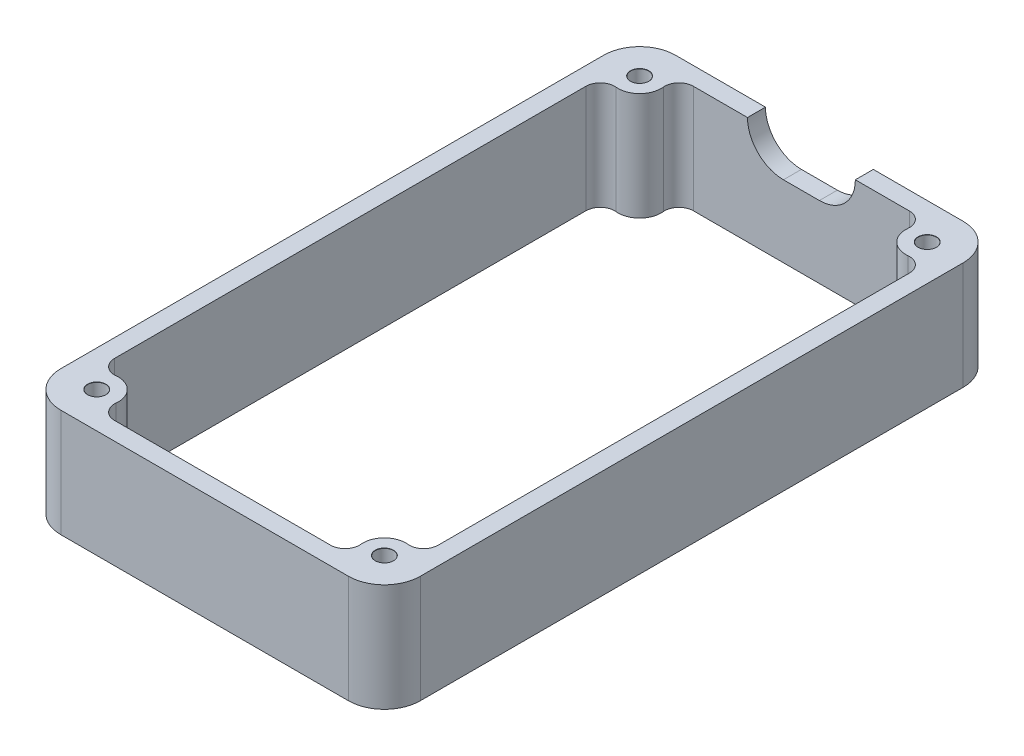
ISO-10303-21;
HEADER;
FILE_DESCRIPTION(('STEP AP214'),'2;1');
FILE_NAME('part.step','',(''),(''),'','','');
FILE_SCHEMA(('AUTOMOTIVE_DESIGN { 1 0 10303 214 1 1 1 1 }'));
ENDSEC;
DATA;
#1=APPLICATION_CONTEXT('core data for automotive mechanical design processes');
#2=APPLICATION_PROTOCOL_DEFINITION('international standard','automotive_design',2000,#1);
#3=PRODUCT_CONTEXT('',#1,'mechanical');
#4=PRODUCT('Part','Part','',(#3));
#5=PRODUCT_RELATED_PRODUCT_CATEGORY('part','',(#4));
#6=PRODUCT_DEFINITION_FORMATION('','',#4);
#7=PRODUCT_DEFINITION_CONTEXT('part definition',#1,'design');
#8=PRODUCT_DEFINITION('design','',#6,#7);
#9=PRODUCT_DEFINITION_SHAPE('','',#8);
#10=(LENGTH_UNIT() NAMED_UNIT(*) SI_UNIT(.MILLI.,.METRE.));
#11=(NAMED_UNIT(*) PLANE_ANGLE_UNIT() SI_UNIT($,.RADIAN.));
#12=(NAMED_UNIT(*) SI_UNIT($,.STERADIAN.) SOLID_ANGLE_UNIT());
#13=UNCERTAINTY_MEASURE_WITH_UNIT(LENGTH_MEASURE(1.E-05),#10,'distance_accuracy_value','');
#14=(GEOMETRIC_REPRESENTATION_CONTEXT(3) GLOBAL_UNCERTAINTY_ASSIGNED_CONTEXT((#13)) GLOBAL_UNIT_ASSIGNED_CONTEXT((#10,
#11,#12)) REPRESENTATION_CONTEXT('',''));
#15=CARTESIAN_POINT('',(0.,0.,0.));
#16=DIRECTION('',(0.,0.,1.));
#17=DIRECTION('',(1.,0.,0.));
#18=AXIS2_PLACEMENT_3D('',#15,#16,#17);
#19=CARTESIAN_POINT('',(0.,15.,0.));
#20=DIRECTION('',(0.,1.,0.));
#21=DIRECTION('',(0.,0.,1.));
#22=AXIS2_PLACEMENT_3D('',#19,#20,#21);
#23=PLANE('',#22);
#24=DIRECTION('',(0.,0.,-1.));
#25=VECTOR('',#24,1.);
#26=CARTESIAN_POINT('',(7.5,15.,0.));
#27=LINE('',#26,#25);
#28=CARTESIAN_POINT('',(7.5,15.,-40.25));
#29=VERTEX_POINT('',#28);
#30=CARTESIAN_POINT('',(7.5,15.,-42.75));
#31=VERTEX_POINT('',#30);
#32=EDGE_CURVE('E244',#29,#31,#27,.T.);
#33=ORIENTED_EDGE('',*,*,#32,.F.);
#34=DIRECTION('',(-1.,0.,0.));
#35=VECTOR('',#34,1.);
#36=CARTESIAN_POINT('',(0.,15.,-40.25));
#37=LINE('',#36,#35);
#38=CARTESIAN_POINT('',(15.0250628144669,15.,-40.25));
#39=VERTEX_POINT('',#38);
#40=EDGE_CURVE('E476',#39,#29,#37,.T.);
#41=ORIENTED_EDGE('',*,*,#40,.F.);
#42=CARTESIAN_POINT('',(15.0250628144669,15.,-38.25));
#43=DIRECTION('',(0.,1.,0.));
#44=DIRECTION('',(0.,0.,1.));
#45=AXIS2_PLACEMENT_3D('',#42,#43,#44);
#46=CIRCLE('',#45,2.);
#47=CARTESIAN_POINT('',(17.0150376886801,15.,-38.05));
#48=VERTEX_POINT('',#47);
#49=EDGE_CURVE('E373',#39,#48,#46,.F.);
#50=ORIENTED_EDGE('',*,*,#49,.T.);
#51=CARTESIAN_POINT('',(20.,15.,-37.75));
#52=DIRECTION('',(0.,1.,0.));
#53=DIRECTION('',(0.,0.,1.));
#54=AXIS2_PLACEMENT_3D('',#51,#52,#53);
#55=CIRCLE('',#54,3.);
#56=CARTESIAN_POINT('',(20.3,15.,-34.7650376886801));
#57=VERTEX_POINT('',#56);
#58=EDGE_CURVE('E473',#48,#57,#55,.T.);
#59=ORIENTED_EDGE('',*,*,#58,.T.);
#60=CARTESIAN_POINT('',(20.5,15.,-32.7750628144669));
#61=DIRECTION('',(0.,1.,0.));
#62=DIRECTION('',(0.,0.,1.));
#63=AXIS2_PLACEMENT_3D('',#60,#61,#62);
#64=CIRCLE('',#63,2.);
#65=CARTESIAN_POINT('',(22.5,15.,-32.7750628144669));
#66=VERTEX_POINT('',#65);
#67=EDGE_CURVE('E369',#57,#66,#64,.F.);
#68=ORIENTED_EDGE('',*,*,#67,.T.);
#69=DIRECTION('',(0.,0.,-1.));
#70=VECTOR('',#69,1.);
#71=CARTESIAN_POINT('',(22.5,15.,0.));
#72=LINE('',#71,#70);
#73=CARTESIAN_POINT('',(22.5,15.,32.7750628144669));
#74=VERTEX_POINT('',#73);
#75=EDGE_CURVE('E470',#74,#66,#72,.T.);
#76=ORIENTED_EDGE('',*,*,#75,.F.);
#77=CARTESIAN_POINT('',(20.5,15.,32.7750628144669));
#78=DIRECTION('',(0.,1.,0.));
#79=DIRECTION('',(0.,0.,1.));
#80=AXIS2_PLACEMENT_3D('',#77,#78,#79);
#81=CIRCLE('',#80,2.);
#82=CARTESIAN_POINT('',(20.3,15.,34.7650376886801));
#83=VERTEX_POINT('',#82);
#84=EDGE_CURVE('E361',#74,#83,#81,.F.);
#85=ORIENTED_EDGE('',*,*,#84,.T.);
#86=CARTESIAN_POINT('',(20.,15.,37.75));
#87=DIRECTION('',(0.,1.,0.));
#88=DIRECTION('',(0.,0.,1.));
#89=AXIS2_PLACEMENT_3D('',#86,#87,#88);
#90=CIRCLE('',#89,3.);
#91=CARTESIAN_POINT('',(17.0150376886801,15.,38.05));
#92=VERTEX_POINT('',#91);
#93=EDGE_CURVE('E467',#83,#92,#90,.T.);
#94=ORIENTED_EDGE('',*,*,#93,.T.);
#95=CARTESIAN_POINT('',(15.0250628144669,15.,38.25));
#96=DIRECTION('',(0.,1.,0.));
#97=DIRECTION('',(0.,0.,1.));
#98=AXIS2_PLACEMENT_3D('',#95,#96,#97);
#99=CIRCLE('',#98,2.);
#100=CARTESIAN_POINT('',(15.0250628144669,15.,40.25));
#101=VERTEX_POINT('',#100);
#102=EDGE_CURVE('E357',#92,#101,#99,.F.);
#103=ORIENTED_EDGE('',*,*,#102,.T.);
#104=DIRECTION('',(1.,0.,0.));
#105=VECTOR('',#104,1.);
#106=CARTESIAN_POINT('',(0.,15.,40.25));
#107=LINE('',#106,#105);
#108=CARTESIAN_POINT('',(-15.0250628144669,15.,40.25));
#109=VERTEX_POINT('',#108);
#110=EDGE_CURVE('E464',#109,#101,#107,.T.);
#111=ORIENTED_EDGE('',*,*,#110,.F.);
#112=CARTESIAN_POINT('',(-15.0250628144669,15.,38.25));
#113=DIRECTION('',(0.,1.,0.));
#114=DIRECTION('',(0.,0.,1.));
#115=AXIS2_PLACEMENT_3D('',#112,#113,#114);
#116=CIRCLE('',#115,2.);
#117=CARTESIAN_POINT('',(-17.0150376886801,15.,38.05));
#118=VERTEX_POINT('',#117);
#119=EDGE_CURVE('E353',#109,#118,#116,.F.);
#120=ORIENTED_EDGE('',*,*,#119,.T.);
#121=CARTESIAN_POINT('',(-20.,15.,37.75));
#122=DIRECTION('',(0.,1.,0.));
#123=DIRECTION('',(0.,0.,1.));
#124=AXIS2_PLACEMENT_3D('',#121,#122,#123);
#125=CIRCLE('',#124,3.);
#126=CARTESIAN_POINT('',(-20.3,15.,34.7650376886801));
#127=VERTEX_POINT('',#126);
#128=EDGE_CURVE('E437',#118,#127,#125,.T.);
#129=ORIENTED_EDGE('',*,*,#128,.T.);
#130=CARTESIAN_POINT('',(-20.5,15.,32.7750628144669));
#131=DIRECTION('',(0.,1.,0.));
#132=DIRECTION('',(0.,0.,1.));
#133=AXIS2_PLACEMENT_3D('',#130,#131,#132);
#134=CIRCLE('',#133,2.);
#135=CARTESIAN_POINT('',(-22.5,15.,32.7750628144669));
#136=VERTEX_POINT('',#135);
#137=EDGE_CURVE('E365',#127,#136,#134,.F.);
#138=ORIENTED_EDGE('',*,*,#137,.T.);
#139=DIRECTION('',(0.,0.,1.));
#140=VECTOR('',#139,1.);
#141=CARTESIAN_POINT('',(-22.5,15.,0.));
#142=LINE('',#141,#140);
#143=CARTESIAN_POINT('',(-22.5,15.,-32.7750628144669));
#144=VERTEX_POINT('',#143);
#145=EDGE_CURVE('E442',#144,#136,#142,.T.);
#146=ORIENTED_EDGE('',*,*,#145,.F.);
#147=CARTESIAN_POINT('',(-20.5,15.,-32.7750628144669));
#148=DIRECTION('',(0.,1.,0.));
#149=DIRECTION('',(0.,0.,1.));
#150=AXIS2_PLACEMENT_3D('',#147,#148,#149);
#151=CIRCLE('',#150,2.);
#152=CARTESIAN_POINT('',(-20.3,15.,-34.7650376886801));
#153=VERTEX_POINT('',#152);
#154=EDGE_CURVE('E381',#144,#153,#151,.F.);
#155=ORIENTED_EDGE('',*,*,#154,.T.);
#156=CARTESIAN_POINT('',(-20.,15.,-37.75));
#157=DIRECTION('',(0.,1.,0.));
#158=DIRECTION('',(0.,0.,1.));
#159=AXIS2_PLACEMENT_3D('',#156,#157,#158);
#160=CIRCLE('',#159,3.);
#161=CARTESIAN_POINT('',(-17.0150376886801,15.,-38.05));
#162=VERTEX_POINT('',#161);
#163=EDGE_CURVE('E478',#153,#162,#160,.T.);
#164=ORIENTED_EDGE('',*,*,#163,.T.);
#165=CARTESIAN_POINT('',(-15.0250628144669,15.,-38.25));
#166=DIRECTION('',(0.,1.,0.));
#167=DIRECTION('',(0.,0.,1.));
#168=AXIS2_PLACEMENT_3D('',#165,#166,#167);
#169=CIRCLE('',#168,2.);
#170=CARTESIAN_POINT('',(-15.0250628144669,15.,-40.25));
#171=VERTEX_POINT('',#170);
#172=EDGE_CURVE('E377',#162,#171,#169,.F.);
#173=ORIENTED_EDGE('',*,*,#172,.T.);
#174=CARTESIAN_POINT('',(-7.5,15.,-40.25));
#175=VERTEX_POINT('',#174);
#176=EDGE_CURVE('E243',#175,#171,#37,.T.);
#177=ORIENTED_EDGE('',*,*,#176,.F.);
#178=DIRECTION('',(0.,0.,1.));
#179=VECTOR('',#178,1.);
#180=CARTESIAN_POINT('',(-7.5,15.,0.));
#181=LINE('',#180,#179);
#182=CARTESIAN_POINT('',(-7.5,15.,-42.75));
#183=VERTEX_POINT('',#182);
#184=EDGE_CURVE('E231',#183,#175,#181,.T.);
#185=ORIENTED_EDGE('',*,*,#184,.F.);
#186=DIRECTION('',(-1.,0.,0.));
#187=VECTOR('',#186,1.);
#188=CARTESIAN_POINT('',(25.,15.,-42.75));
#189=LINE('',#188,#187);
#190=CARTESIAN_POINT('',(-20.,15.,-42.75));
#191=VERTEX_POINT('',#190);
#192=EDGE_CURVE('E240',#183,#191,#189,.T.);
#193=ORIENTED_EDGE('',*,*,#192,.T.);
#194=CARTESIAN_POINT('',(-20.,15.,-37.75));
#195=DIRECTION('',(0.,1.,0.));
#196=DIRECTION('',(0.,0.,1.));
#197=AXIS2_PLACEMENT_3D('',#194,#195,#196);
#198=CIRCLE('',#197,5.);
#199=CARTESIAN_POINT('',(-25.,15.,-37.75));
#200=VERTEX_POINT('',#199);
#201=EDGE_CURVE('E301',#191,#200,#198,.T.);
#202=ORIENTED_EDGE('',*,*,#201,.T.);
#203=DIRECTION('',(0.,0.,-1.));
#204=VECTOR('',#203,1.);
#205=CARTESIAN_POINT('',(-25.,15.,42.75));
#206=LINE('',#205,#204);
#207=CARTESIAN_POINT('',(-25.,15.,37.75));
#208=VERTEX_POINT('',#207);
#209=EDGE_CURVE('E256',#208,#200,#206,.T.);
#210=ORIENTED_EDGE('',*,*,#209,.F.);
#211=CARTESIAN_POINT('',(-20.,15.,37.75));
#212=DIRECTION('',(0.,1.,0.));
#213=DIRECTION('',(0.,0.,1.));
#214=AXIS2_PLACEMENT_3D('',#211,#212,#213);
#215=CIRCLE('',#214,5.);
#216=CARTESIAN_POINT('',(-20.,15.,42.75));
#217=VERTEX_POINT('',#216);
#218=EDGE_CURVE('E295',#208,#217,#215,.T.);
#219=ORIENTED_EDGE('',*,*,#218,.T.);
#220=DIRECTION('',(-1.,0.,0.));
#221=VECTOR('',#220,1.);
#222=CARTESIAN_POINT('',(25.,15.,42.75));
#223=LINE('',#222,#221);
#224=CARTESIAN_POINT('',(20.,15.,42.75));
#225=VERTEX_POINT('',#224);
#226=EDGE_CURVE('E264',#225,#217,#223,.T.);
#227=ORIENTED_EDGE('',*,*,#226,.F.);
#228=CARTESIAN_POINT('',(20.,15.,37.75));
#229=DIRECTION('',(0.,1.,0.));
#230=DIRECTION('',(0.,0.,1.));
#231=AXIS2_PLACEMENT_3D('',#228,#229,#230);
#232=CIRCLE('',#231,5.);
#233=CARTESIAN_POINT('',(25.,15.,37.75));
#234=VERTEX_POINT('',#233);
#235=EDGE_CURVE('E297',#225,#234,#232,.T.);
#236=ORIENTED_EDGE('',*,*,#235,.T.);
#237=DIRECTION('',(0.,0.,-1.));
#238=VECTOR('',#237,1.);
#239=CARTESIAN_POINT('',(25.,15.,42.75));
#240=LINE('',#239,#238);
#241=CARTESIAN_POINT('',(25.,15.,-37.75));
#242=VERTEX_POINT('',#241);
#243=EDGE_CURVE('E253',#234,#242,#240,.T.);
#244=ORIENTED_EDGE('',*,*,#243,.T.);
#245=CARTESIAN_POINT('',(20.,15.,-37.75));
#246=DIRECTION('',(0.,1.,0.));
#247=DIRECTION('',(0.,0.,1.));
#248=AXIS2_PLACEMENT_3D('',#245,#246,#247);
#249=CIRCLE('',#248,5.);
#250=CARTESIAN_POINT('',(20.,15.,-42.75));
#251=VERTEX_POINT('',#250);
#252=EDGE_CURVE('E299',#242,#251,#249,.T.);
#253=ORIENTED_EDGE('',*,*,#252,.T.);
#254=EDGE_CURVE('E252',#251,#31,#189,.T.);
#255=ORIENTED_EDGE('',*,*,#254,.T.);
#256=EDGE_LOOP('',(#33,#41,#50,#59,#68,#76,#85,#94,#103,#111,#120,#129,#138,#146,#155,#164,#173,
#177,#185,#193,#202,#210,#219,#227,#236,#244,#253,#255));
#257=FACE_BOUND('',#256,.T.);
#258=CARTESIAN_POINT('',(-20.,15.,-37.75));
#259=DIRECTION('',(0.,1.,0.));
#260=DIRECTION('',(0.,0.,1.));
#261=AXIS2_PLACEMENT_3D('',#258,#259,#260);
#262=CIRCLE('',#261,1.275);
#263=CARTESIAN_POINT('',(-20.,15.,-36.475));
#264=VERTEX_POINT('',#263);
#265=EDGE_CURVE('E398',#264,#264,#262,.T.);
#266=ORIENTED_EDGE('',*,*,#265,.F.);
#267=EDGE_LOOP('',(#266));
#268=FACE_BOUND('',#267,.T.);
#269=CARTESIAN_POINT('',(20.,15.,-37.75));
#270=DIRECTION('',(0.,1.,0.));
#271=DIRECTION('',(0.,0.,1.));
#272=AXIS2_PLACEMENT_3D('',#269,#270,#271);
#273=CIRCLE('',#272,1.275);
#274=CARTESIAN_POINT('',(20.,15.,-36.475));
#275=VERTEX_POINT('',#274);
#276=EDGE_CURVE('E410',#275,#275,#273,.T.);
#277=ORIENTED_EDGE('',*,*,#276,.F.);
#278=EDGE_LOOP('',(#277));
#279=FACE_BOUND('',#278,.T.);
#280=CARTESIAN_POINT('',(-20.,15.,37.75));
#281=DIRECTION('',(0.,1.,0.));
#282=DIRECTION('',(0.,0.,1.));
#283=AXIS2_PLACEMENT_3D('',#280,#281,#282);
#284=CIRCLE('',#283,1.275);
#285=CARTESIAN_POINT('',(-20.,15.,39.025));
#286=VERTEX_POINT('',#285);
#287=EDGE_CURVE('E419',#286,#286,#284,.T.);
#288=ORIENTED_EDGE('',*,*,#287,.F.);
#289=EDGE_LOOP('',(#288));
#290=FACE_BOUND('',#289,.T.);
#291=CARTESIAN_POINT('',(20.,15.,37.75));
#292=DIRECTION('',(0.,1.,0.));
#293=DIRECTION('',(0.,0.,1.));
#294=AXIS2_PLACEMENT_3D('',#291,#292,#293);
#295=CIRCLE('',#294,1.275);
#296=CARTESIAN_POINT('',(20.,15.,39.025));
#297=VERTEX_POINT('',#296);
#298=EDGE_CURVE('E428',#297,#297,#295,.T.);
#299=ORIENTED_EDGE('',*,*,#298,.F.);
#300=EDGE_LOOP('',(#299));
#301=FACE_BOUND('',#300,.T.);
#302=ADVANCED_FACE('F43',(#257,#268,#279,#290,#301),#23,.T.);
#303=CARTESIAN_POINT('',(0.,0.,0.));
#304=DIRECTION('',(0.,1.,0.));
#305=DIRECTION('',(0.,0.,1.));
#306=AXIS2_PLACEMENT_3D('',#303,#304,#305);
#307=PLANE('',#306);
#308=CARTESIAN_POINT('',(-20.,0.,-37.75));
#309=DIRECTION('',(0.,1.,0.));
#310=DIRECTION('',(0.,0.,1.));
#311=AXIS2_PLACEMENT_3D('',#308,#309,#310);
#312=CIRCLE('',#311,1.25);
#313=CARTESIAN_POINT('',(-20.,0.,-36.5));
#314=VERTEX_POINT('',#313);
#315=EDGE_CURVE('E407',#314,#314,#312,.T.);
#316=ORIENTED_EDGE('',*,*,#315,.T.);
#317=EDGE_LOOP('',(#316));
#318=FACE_BOUND('',#317,.T.);
#319=CARTESIAN_POINT('',(20.,0.,-37.75));
#320=DIRECTION('',(0.,1.,0.));
#321=DIRECTION('',(0.,0.,1.));
#322=AXIS2_PLACEMENT_3D('',#319,#320,#321);
#323=CIRCLE('',#322,1.25);
#324=CARTESIAN_POINT('',(20.,0.,-36.5));
#325=VERTEX_POINT('',#324);
#326=EDGE_CURVE('E416',#325,#325,#323,.T.);
#327=ORIENTED_EDGE('',*,*,#326,.T.);
#328=EDGE_LOOP('',(#327));
#329=FACE_BOUND('',#328,.T.);
#330=CARTESIAN_POINT('',(-20.,0.,37.75));
#331=DIRECTION('',(0.,1.,0.));
#332=DIRECTION('',(0.,0.,1.));
#333=AXIS2_PLACEMENT_3D('',#330,#331,#332);
#334=CIRCLE('',#333,1.25);
#335=CARTESIAN_POINT('',(-20.,0.,39.));
#336=VERTEX_POINT('',#335);
#337=EDGE_CURVE('E425',#336,#336,#334,.T.);
#338=ORIENTED_EDGE('',*,*,#337,.T.);
#339=EDGE_LOOP('',(#338));
#340=FACE_BOUND('',#339,.T.);
#341=CARTESIAN_POINT('',(20.,0.,37.75));
#342=DIRECTION('',(0.,1.,0.));
#343=DIRECTION('',(0.,0.,1.));
#344=AXIS2_PLACEMENT_3D('',#341,#342,#343);
#345=CIRCLE('',#344,1.25);
#346=CARTESIAN_POINT('',(20.,0.,39.));
#347=VERTEX_POINT('',#346);
#348=EDGE_CURVE('E434',#347,#347,#345,.T.);
#349=ORIENTED_EDGE('',*,*,#348,.T.);
#350=EDGE_LOOP('',(#349));
#351=FACE_BOUND('',#350,.T.);
#352=DIRECTION('',(0.,0.,-1.));
#353=VECTOR('',#352,1.);
#354=CARTESIAN_POINT('',(-25.,0.,42.75));
#355=LINE('',#354,#353);
#356=CARTESIAN_POINT('',(-25.,0.,37.75));
#357=VERTEX_POINT('',#356);
#358=CARTESIAN_POINT('',(-25.,0.,-37.75));
#359=VERTEX_POINT('',#358);
#360=EDGE_CURVE('E274',#357,#359,#355,.T.);
#361=ORIENTED_EDGE('',*,*,#360,.T.);
#362=CARTESIAN_POINT('',(-20.,0.,-37.75));
#363=DIRECTION('',(0.,1.,0.));
#364=DIRECTION('',(0.,0.,1.));
#365=AXIS2_PLACEMENT_3D('',#362,#363,#364);
#366=CIRCLE('',#365,5.);
#367=CARTESIAN_POINT('',(-20.,0.,-42.75));
#368=VERTEX_POINT('',#367);
#369=EDGE_CURVE('E289',#359,#368,#366,.F.);
#370=ORIENTED_EDGE('',*,*,#369,.T.);
#371=DIRECTION('',(-1.,0.,0.));
#372=VECTOR('',#371,1.);
#373=CARTESIAN_POINT('',(25.,0.,-42.75));
#374=LINE('',#373,#372);
#375=CARTESIAN_POINT('',(20.,0.,-42.75));
#376=VERTEX_POINT('',#375);
#377=EDGE_CURVE('E271',#376,#368,#374,.T.);
#378=ORIENTED_EDGE('',*,*,#377,.F.);
#379=CARTESIAN_POINT('',(20.,0.,-37.75));
#380=DIRECTION('',(0.,1.,0.));
#381=DIRECTION('',(0.,0.,1.));
#382=AXIS2_PLACEMENT_3D('',#379,#380,#381);
#383=CIRCLE('',#382,5.);
#384=CARTESIAN_POINT('',(25.,0.,-37.75));
#385=VERTEX_POINT('',#384);
#386=EDGE_CURVE('E287',#376,#385,#383,.F.);
#387=ORIENTED_EDGE('',*,*,#386,.T.);
#388=DIRECTION('',(0.,0.,-1.));
#389=VECTOR('',#388,1.);
#390=CARTESIAN_POINT('',(25.,0.,42.75));
#391=LINE('',#390,#389);
#392=CARTESIAN_POINT('',(25.,0.,37.75));
#393=VERTEX_POINT('',#392);
#394=EDGE_CURVE('E268',#393,#385,#391,.T.);
#395=ORIENTED_EDGE('',*,*,#394,.F.);
#396=CARTESIAN_POINT('',(20.,0.,37.75));
#397=DIRECTION('',(0.,1.,0.));
#398=DIRECTION('',(0.,0.,1.));
#399=AXIS2_PLACEMENT_3D('',#396,#397,#398);
#400=CIRCLE('',#399,5.);
#401=CARTESIAN_POINT('',(20.,0.,42.75));
#402=VERTEX_POINT('',#401);
#403=EDGE_CURVE('E285',#393,#402,#400,.F.);
#404=ORIENTED_EDGE('',*,*,#403,.T.);
#405=DIRECTION('',(-1.,0.,0.));
#406=VECTOR('',#405,1.);
#407=CARTESIAN_POINT('',(25.,0.,42.75));
#408=LINE('',#407,#406);
#409=CARTESIAN_POINT('',(-20.,0.,42.75));
#410=VERTEX_POINT('',#409);
#411=EDGE_CURVE('E258',#402,#410,#408,.T.);
#412=ORIENTED_EDGE('',*,*,#411,.T.);
#413=CARTESIAN_POINT('',(-20.,0.,37.75));
#414=DIRECTION('',(0.,1.,0.));
#415=DIRECTION('',(0.,0.,1.));
#416=AXIS2_PLACEMENT_3D('',#413,#414,#415);
#417=CIRCLE('',#416,5.);
#418=EDGE_CURVE('E283',#410,#357,#417,.F.);
#419=ORIENTED_EDGE('',*,*,#418,.T.);
#420=EDGE_LOOP('',(#361,#370,#378,#387,#395,#404,#412,#419));
#421=FACE_BOUND('',#420,.T.);
#422=CARTESIAN_POINT('',(-20.,0.,37.75));
#423=DIRECTION('',(0.,1.,0.));
#424=DIRECTION('',(0.,0.,1.));
#425=AXIS2_PLACEMENT_3D('',#422,#423,#424);
#426=CIRCLE('',#425,3.);
#427=CARTESIAN_POINT('',(-17.0150376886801,0.,38.05));
#428=VERTEX_POINT('',#427);
#429=CARTESIAN_POINT('',(-20.3,0.,34.7650376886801));
#430=VERTEX_POINT('',#429);
#431=EDGE_CURVE('E438',#428,#430,#426,.T.);
#432=ORIENTED_EDGE('',*,*,#431,.F.);
#433=CARTESIAN_POINT('',(-15.0250628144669,0.,38.25));
#434=DIRECTION('',(0.,1.,0.));
#435=DIRECTION('',(0.,0.,1.));
#436=AXIS2_PLACEMENT_3D('',#433,#434,#435);
#437=CIRCLE('',#436,2.);
#438=CARTESIAN_POINT('',(-15.0250628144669,0.,40.25));
#439=VERTEX_POINT('',#438);
#440=EDGE_CURVE('E355',#428,#439,#437,.T.);
#441=ORIENTED_EDGE('',*,*,#440,.T.);
#442=DIRECTION('',(1.,0.,0.));
#443=VECTOR('',#442,1.);
#444=CARTESIAN_POINT('',(0.,0.,40.25));
#445=LINE('',#444,#443);
#446=CARTESIAN_POINT('',(15.0250628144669,0.,40.25));
#447=VERTEX_POINT('',#446);
#448=EDGE_CURVE('E441',#439,#447,#445,.T.);
#449=ORIENTED_EDGE('',*,*,#448,.T.);
#450=CARTESIAN_POINT('',(15.0250628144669,0.,38.25));
#451=DIRECTION('',(0.,1.,0.));
#452=DIRECTION('',(0.,0.,1.));
#453=AXIS2_PLACEMENT_3D('',#450,#451,#452);
#454=CIRCLE('',#453,2.);
#455=CARTESIAN_POINT('',(17.0150376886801,0.,38.05));
#456=VERTEX_POINT('',#455);
#457=EDGE_CURVE('E359',#447,#456,#454,.T.);
#458=ORIENTED_EDGE('',*,*,#457,.T.);
#459=CARTESIAN_POINT('',(20.,0.,37.75));
#460=DIRECTION('',(0.,1.,0.));
#461=DIRECTION('',(0.,0.,1.));
#462=AXIS2_PLACEMENT_3D('',#459,#460,#461);
#463=CIRCLE('',#462,3.);
#464=CARTESIAN_POINT('',(20.3,0.,34.7650376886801));
#465=VERTEX_POINT('',#464);
#466=EDGE_CURVE('E445',#465,#456,#463,.T.);
#467=ORIENTED_EDGE('',*,*,#466,.F.);
#468=CARTESIAN_POINT('',(20.5,0.,32.7750628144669));
#469=DIRECTION('',(0.,1.,0.));
#470=DIRECTION('',(0.,0.,1.));
#471=AXIS2_PLACEMENT_3D('',#468,#469,#470);
#472=CIRCLE('',#471,2.);
#473=CARTESIAN_POINT('',(22.5,0.,32.7750628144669));
#474=VERTEX_POINT('',#473);
#475=EDGE_CURVE('E363',#465,#474,#472,.T.);
#476=ORIENTED_EDGE('',*,*,#475,.T.);
#477=DIRECTION('',(0.,0.,-1.));
#478=VECTOR('',#477,1.);
#479=CARTESIAN_POINT('',(22.5,0.,0.));
#480=LINE('',#479,#478);
#481=CARTESIAN_POINT('',(22.5,0.,-32.7750628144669));
#482=VERTEX_POINT('',#481);
#483=EDGE_CURVE('E448',#474,#482,#480,.T.);
#484=ORIENTED_EDGE('',*,*,#483,.T.);
#485=CARTESIAN_POINT('',(20.5,0.,-32.7750628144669));
#486=DIRECTION('',(0.,1.,0.));
#487=DIRECTION('',(0.,0.,1.));
#488=AXIS2_PLACEMENT_3D('',#485,#486,#487);
#489=CIRCLE('',#488,2.);
#490=CARTESIAN_POINT('',(20.3,0.,-34.7650376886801));
#491=VERTEX_POINT('',#490);
#492=EDGE_CURVE('E371',#482,#491,#489,.T.);
#493=ORIENTED_EDGE('',*,*,#492,.T.);
#494=CARTESIAN_POINT('',(20.,0.,-37.75));
#495=DIRECTION('',(0.,1.,0.));
#496=DIRECTION('',(0.,0.,1.));
#497=AXIS2_PLACEMENT_3D('',#494,#495,#496);
#498=CIRCLE('',#497,3.);
#499=CARTESIAN_POINT('',(17.0150376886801,0.,-38.05));
#500=VERTEX_POINT('',#499);
#501=EDGE_CURVE('E451',#500,#491,#498,.T.);
#502=ORIENTED_EDGE('',*,*,#501,.F.);
#503=CARTESIAN_POINT('',(15.0250628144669,0.,-38.25));
#504=DIRECTION('',(0.,1.,0.));
#505=DIRECTION('',(0.,0.,1.));
#506=AXIS2_PLACEMENT_3D('',#503,#504,#505);
#507=CIRCLE('',#506,2.);
#508=CARTESIAN_POINT('',(15.0250628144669,0.,-40.25));
#509=VERTEX_POINT('',#508);
#510=EDGE_CURVE('E375',#500,#509,#507,.T.);
#511=ORIENTED_EDGE('',*,*,#510,.T.);
#512=DIRECTION('',(-1.,0.,0.));
#513=VECTOR('',#512,1.);
#514=CARTESIAN_POINT('',(0.,0.,-40.25));
#515=LINE('',#514,#513);
#516=CARTESIAN_POINT('',(-15.0250628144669,0.,-40.25));
#517=VERTEX_POINT('',#516);
#518=EDGE_CURVE('E454',#509,#517,#515,.T.);
#519=ORIENTED_EDGE('',*,*,#518,.T.);
#520=CARTESIAN_POINT('',(-15.0250628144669,0.,-38.25));
#521=DIRECTION('',(0.,1.,0.));
#522=DIRECTION('',(0.,0.,1.));
#523=AXIS2_PLACEMENT_3D('',#520,#521,#522);
#524=CIRCLE('',#523,2.);
#525=CARTESIAN_POINT('',(-17.0150376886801,0.,-38.05));
#526=VERTEX_POINT('',#525);
#527=EDGE_CURVE('E379',#517,#526,#524,.T.);
#528=ORIENTED_EDGE('',*,*,#527,.T.);
#529=CARTESIAN_POINT('',(-20.,0.,-37.75));
#530=DIRECTION('',(0.,1.,0.));
#531=DIRECTION('',(0.,0.,1.));
#532=AXIS2_PLACEMENT_3D('',#529,#530,#531);
#533=CIRCLE('',#532,3.);
#534=CARTESIAN_POINT('',(-20.3,0.,-34.7650376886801));
#535=VERTEX_POINT('',#534);
#536=EDGE_CURVE('E457',#535,#526,#533,.T.);
#537=ORIENTED_EDGE('',*,*,#536,.F.);
#538=CARTESIAN_POINT('',(-20.5,0.,-32.7750628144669));
#539=DIRECTION('',(0.,1.,0.));
#540=DIRECTION('',(0.,0.,1.));
#541=AXIS2_PLACEMENT_3D('',#538,#539,#540);
#542=CIRCLE('',#541,2.);
#543=CARTESIAN_POINT('',(-22.5,0.,-32.7750628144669));
#544=VERTEX_POINT('',#543);
#545=EDGE_CURVE('E383',#535,#544,#542,.T.);
#546=ORIENTED_EDGE('',*,*,#545,.T.);
#547=DIRECTION('',(0.,0.,1.));
#548=VECTOR('',#547,1.);
#549=CARTESIAN_POINT('',(-22.5,0.,0.));
#550=LINE('',#549,#548);
#551=CARTESIAN_POINT('',(-22.5,0.,32.7750628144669));
#552=VERTEX_POINT('',#551);
#553=EDGE_CURVE('E272',#544,#552,#550,.T.);
#554=ORIENTED_EDGE('',*,*,#553,.T.);
#555=CARTESIAN_POINT('',(-20.5,0.,32.7750628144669));
#556=DIRECTION('',(0.,1.,0.));
#557=DIRECTION('',(0.,0.,1.));
#558=AXIS2_PLACEMENT_3D('',#555,#556,#557);
#559=CIRCLE('',#558,2.);
#560=EDGE_CURVE('E367',#552,#430,#559,.T.);
#561=ORIENTED_EDGE('',*,*,#560,.T.);
#562=EDGE_LOOP('',(#432,#441,#449,#458,#467,#476,#484,#493,#502,#511,#519,#528,#537,#546,#554,#561));
#563=FACE_BOUND('',#562,.T.);
#564=ADVANCED_FACE('F493',(#318,#329,#340,#351,#421,#563),#307,.F.);
#565=CARTESIAN_POINT('',(25.,15.,42.75));
#566=DIRECTION('',(-1.,0.,0.));
#567=DIRECTION('',(0.,0.,1.));
#568=AXIS2_PLACEMENT_3D('',#565,#566,#567);
#569=PLANE('',#568);
#570=ORIENTED_EDGE('',*,*,#394,.T.);
#571=DIRECTION('',(0.,-1.,0.));
#572=VECTOR('',#571,1.);
#573=CARTESIAN_POINT('',(25.,15.,-37.75));
#574=LINE('',#573,#572);
#575=EDGE_CURVE('E306',#385,#242,#574,.F.);
#576=ORIENTED_EDGE('',*,*,#575,.T.);
#577=ORIENTED_EDGE('',*,*,#243,.F.);
#578=DIRECTION('',(0.,-1.,0.));
#579=VECTOR('',#578,1.);
#580=CARTESIAN_POINT('',(25.,0.,37.75));
#581=LINE('',#580,#579);
#582=EDGE_CURVE('E303',#234,#393,#581,.T.);
#583=ORIENTED_EDGE('',*,*,#582,.T.);
#584=EDGE_LOOP('',(#570,#576,#577,#583));
#585=FACE_BOUND('',#584,.T.);
#586=ADVANCED_FACE('F571',(#585),#569,.F.);
#587=CARTESIAN_POINT('',(25.,15.,-42.75));
#588=DIRECTION('',(0.,0.,1.));
#589=DIRECTION('',(1.,0.,0.));
#590=AXIS2_PLACEMENT_3D('',#587,#588,#589);
#591=PLANE('',#590);
#592=DIRECTION('',(-1.,0.,0.));
#593=VECTOR('',#592,1.);
#594=CARTESIAN_POINT('',(-7.5,10.,-42.75));
#595=LINE('',#594,#593);
#596=CARTESIAN_POINT('',(2.5,10.,-42.75));
#597=VERTEX_POINT('',#596);
#598=CARTESIAN_POINT('',(-2.5,10.,-42.75));
#599=VERTEX_POINT('',#598);
#600=EDGE_CURVE('E245',#597,#599,#595,.T.);
#601=ORIENTED_EDGE('',*,*,#600,.F.);
#602=CARTESIAN_POINT('',(2.5,15.,-42.75));
#603=DIRECTION('',(0.,0.,1.));
#604=DIRECTION('',(1.,0.,0.));
#605=AXIS2_PLACEMENT_3D('',#602,#603,#604);
#606=CIRCLE('',#605,5.);
#607=EDGE_CURVE('E51',#597,#31,#606,.T.);
#608=ORIENTED_EDGE('',*,*,#607,.T.);
#609=ORIENTED_EDGE('',*,*,#254,.F.);
#610=DIRECTION('',(0.,-1.,0.));
#611=VECTOR('',#610,1.);
#612=CARTESIAN_POINT('',(20.,15.,-42.75));
#613=LINE('',#612,#611);
#614=EDGE_CURVE('E291',#251,#376,#613,.T.);
#615=ORIENTED_EDGE('',*,*,#614,.T.);
#616=ORIENTED_EDGE('',*,*,#377,.T.);
#617=DIRECTION('',(0.,-1.,0.));
#618=VECTOR('',#617,1.);
#619=CARTESIAN_POINT('',(-20.,15.,-42.75));
#620=LINE('',#619,#618);
#621=EDGE_CURVE('E250',#368,#191,#620,.F.);
#622=ORIENTED_EDGE('',*,*,#621,.T.);
#623=ORIENTED_EDGE('',*,*,#192,.F.);
#624=CARTESIAN_POINT('',(-2.5,15.,-42.75));
#625=DIRECTION('',(0.,0.,1.));
#626=DIRECTION('',(1.,0.,0.));
#627=AXIS2_PLACEMENT_3D('',#624,#625,#626);
#628=CIRCLE('',#627,5.);
#629=EDGE_CURVE('E227',#183,#599,#628,.T.);
#630=ORIENTED_EDGE('',*,*,#629,.T.);
#631=EDGE_LOOP('',(#601,#608,#609,#615,#616,#622,#623,#630));
#632=FACE_BOUND('',#631,.T.);
#633=ADVANCED_FACE('F247',(#632),#591,.F.);
#634=CARTESIAN_POINT('',(-25.,15.,42.75));
#635=DIRECTION('',(-1.,0.,0.));
#636=DIRECTION('',(0.,0.,1.));
#637=AXIS2_PLACEMENT_3D('',#634,#635,#636);
#638=PLANE('',#637);
#639=ORIENTED_EDGE('',*,*,#209,.T.);
#640=DIRECTION('',(0.,-1.,0.));
#641=VECTOR('',#640,1.);
#642=CARTESIAN_POINT('',(-25.,0.,-37.75));
#643=LINE('',#642,#641);
#644=EDGE_CURVE('E280',#200,#359,#643,.T.);
#645=ORIENTED_EDGE('',*,*,#644,.T.);
#646=ORIENTED_EDGE('',*,*,#360,.F.);
#647=DIRECTION('',(0.,-1.,0.));
#648=VECTOR('',#647,1.);
#649=CARTESIAN_POINT('',(-25.,15.,37.75));
#650=LINE('',#649,#648);
#651=EDGE_CURVE('E267',#357,#208,#650,.F.);
#652=ORIENTED_EDGE('',*,*,#651,.T.);
#653=EDGE_LOOP('',(#639,#645,#646,#652));
#654=FACE_BOUND('',#653,.T.);
#655=ADVANCED_FACE('F581',(#654),#638,.T.);
#656=CARTESIAN_POINT('',(25.,15.,42.75));
#657=DIRECTION('',(0.,0.,1.));
#658=DIRECTION('',(1.,0.,0.));
#659=AXIS2_PLACEMENT_3D('',#656,#657,#658);
#660=PLANE('',#659);
#661=ORIENTED_EDGE('',*,*,#411,.F.);
#662=DIRECTION('',(0.,-1.,0.));
#663=VECTOR('',#662,1.);
#664=CARTESIAN_POINT('',(20.,15.,42.75));
#665=LINE('',#664,#663);
#666=EDGE_CURVE('E311',#402,#225,#665,.F.);
#667=ORIENTED_EDGE('',*,*,#666,.T.);
#668=ORIENTED_EDGE('',*,*,#226,.T.);
#669=DIRECTION('',(0.,-1.,0.));
#670=VECTOR('',#669,1.);
#671=CARTESIAN_POINT('',(-20.,15.,42.75));
#672=LINE('',#671,#670);
#673=EDGE_CURVE('E308',#217,#410,#672,.T.);
#674=ORIENTED_EDGE('',*,*,#673,.T.);
#675=EDGE_LOOP('',(#661,#667,#668,#674));
#676=FACE_BOUND('',#675,.T.);
#677=ADVANCED_FACE('F577',(#676),#660,.T.);
#678=CARTESIAN_POINT('',(-20.,15.,-37.75));
#679=DIRECTION('',(0.,1.,0.));
#680=DIRECTION('',(0.,0.,1.));
#681=AXIS2_PLACEMENT_3D('',#678,#679,#680);
#682=CYLINDRICAL_SURFACE('',#681,5.);
#683=ORIENTED_EDGE('',*,*,#201,.F.);
#684=ORIENTED_EDGE('',*,*,#621,.F.);
#685=ORIENTED_EDGE('',*,*,#369,.F.);
#686=ORIENTED_EDGE('',*,*,#644,.F.);
#687=EDGE_LOOP('',(#683,#684,#685,#686));
#688=FACE_BOUND('',#687,.T.);
#689=ADVANCED_FACE('F580',(#688),#682,.T.);
#690=CARTESIAN_POINT('',(20.,15.,-37.75));
#691=DIRECTION('',(0.,-1.,0.));
#692=DIRECTION('',(0.,0.,-1.));
#693=AXIS2_PLACEMENT_3D('',#690,#691,#692);
#694=CYLINDRICAL_SURFACE('',#693,5.);
#695=ORIENTED_EDGE('',*,*,#252,.F.);
#696=ORIENTED_EDGE('',*,*,#575,.F.);
#697=ORIENTED_EDGE('',*,*,#386,.F.);
#698=ORIENTED_EDGE('',*,*,#614,.F.);
#699=EDGE_LOOP('',(#695,#696,#697,#698));
#700=FACE_BOUND('',#699,.T.);
#701=ADVANCED_FACE('F592',(#700),#694,.T.);
#702=CARTESIAN_POINT('',(20.,15.,37.75));
#703=DIRECTION('',(0.,1.,0.));
#704=DIRECTION('',(0.,0.,1.));
#705=AXIS2_PLACEMENT_3D('',#702,#703,#704);
#706=CYLINDRICAL_SURFACE('',#705,5.);
#707=ORIENTED_EDGE('',*,*,#235,.F.);
#708=ORIENTED_EDGE('',*,*,#666,.F.);
#709=ORIENTED_EDGE('',*,*,#403,.F.);
#710=ORIENTED_EDGE('',*,*,#582,.F.);
#711=EDGE_LOOP('',(#707,#708,#709,#710));
#712=FACE_BOUND('',#711,.T.);
#713=ADVANCED_FACE('F596',(#712),#706,.T.);
#714=CARTESIAN_POINT('',(-20.,15.,37.75));
#715=DIRECTION('',(0.,-1.,0.));
#716=DIRECTION('',(0.,0.,-1.));
#717=AXIS2_PLACEMENT_3D('',#714,#715,#716);
#718=CYLINDRICAL_SURFACE('',#717,5.);
#719=ORIENTED_EDGE('',*,*,#218,.F.);
#720=ORIENTED_EDGE('',*,*,#651,.F.);
#721=ORIENTED_EDGE('',*,*,#418,.F.);
#722=ORIENTED_EDGE('',*,*,#673,.F.);
#723=EDGE_LOOP('',(#719,#720,#721,#722));
#724=FACE_BOUND('',#723,.T.);
#725=ADVANCED_FACE('F600',(#724),#718,.T.);
#726=CARTESIAN_POINT('',(-20.,0.,37.75));
#727=DIRECTION('',(0.,1.,0.));
#728=DIRECTION('',(0.,0.,1.));
#729=AXIS2_PLACEMENT_3D('',#726,#727,#728);
#730=CYLINDRICAL_SURFACE('',#729,3.);
#731=ORIENTED_EDGE('',*,*,#128,.F.);
#732=DIRECTION('',(0.,1.,0.));
#733=VECTOR('',#732,1.);
#734=CARTESIAN_POINT('',(-17.0150376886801,0.,38.05));
#735=LINE('',#734,#733);
#736=EDGE_CURVE('E321',#118,#428,#735,.F.);
#737=ORIENTED_EDGE('',*,*,#736,.T.);
#738=ORIENTED_EDGE('',*,*,#431,.T.);
#739=DIRECTION('',(0.,1.,0.));
#740=VECTOR('',#739,1.);
#741=CARTESIAN_POINT('',(-20.3,0.,34.7650376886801));
#742=LINE('',#741,#740);
#743=EDGE_CURVE('E318',#430,#127,#742,.T.);
#744=ORIENTED_EDGE('',*,*,#743,.T.);
#745=EDGE_LOOP('',(#731,#737,#738,#744));
#746=FACE_BOUND('',#745,.T.);
#747=ADVANCED_FACE('F497',(#746),#730,.T.);
#748=CARTESIAN_POINT('',(-22.5,0.,0.));
#749=DIRECTION('',(-1.,0.,0.));
#750=DIRECTION('',(0.,0.,1.));
#751=AXIS2_PLACEMENT_3D('',#748,#749,#750);
#752=PLANE('',#751);
#753=ORIENTED_EDGE('',*,*,#145,.T.);
#754=DIRECTION('',(0.,1.,0.));
#755=VECTOR('',#754,1.);
#756=CARTESIAN_POINT('',(-22.5,0.,32.7750628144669));
#757=LINE('',#756,#755);
#758=EDGE_CURVE('E336',#136,#552,#757,.F.);
#759=ORIENTED_EDGE('',*,*,#758,.T.);
#760=ORIENTED_EDGE('',*,*,#553,.F.);
#761=DIRECTION('',(0.,1.,0.));
#762=VECTOR('',#761,1.);
#763=CARTESIAN_POINT('',(-22.5,0.,-32.7750628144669));
#764=LINE('',#763,#762);
#765=EDGE_CURVE('E333',#544,#144,#764,.T.);
#766=ORIENTED_EDGE('',*,*,#765,.T.);
#767=EDGE_LOOP('',(#753,#759,#760,#766));
#768=FACE_BOUND('',#767,.T.);
#769=ADVANCED_FACE('F484',(#768),#752,.F.);
#770=CARTESIAN_POINT('',(-20.,0.,-37.75));
#771=DIRECTION('',(0.,1.,0.));
#772=DIRECTION('',(0.,0.,1.));
#773=AXIS2_PLACEMENT_3D('',#770,#771,#772);
#774=CYLINDRICAL_SURFACE('',#773,3.);
#775=ORIENTED_EDGE('',*,*,#536,.T.);
#776=DIRECTION('',(0.,1.,0.));
#777=VECTOR('',#776,1.);
#778=CARTESIAN_POINT('',(-17.0150376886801,0.,-38.05));
#779=LINE('',#778,#777);
#780=EDGE_CURVE('E350',#526,#162,#779,.T.);
#781=ORIENTED_EDGE('',*,*,#780,.T.);
#782=ORIENTED_EDGE('',*,*,#163,.F.);
#783=DIRECTION('',(0.,1.,0.));
#784=VECTOR('',#783,1.);
#785=CARTESIAN_POINT('',(-20.3,0.,-34.7650376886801));
#786=LINE('',#785,#784);
#787=EDGE_CURVE('E348',#153,#535,#786,.F.);
#788=ORIENTED_EDGE('',*,*,#787,.T.);
#789=EDGE_LOOP('',(#775,#781,#782,#788));
#790=FACE_BOUND('',#789,.T.);
#791=ADVANCED_FACE('F548',(#790),#774,.T.);
#792=CARTESIAN_POINT('',(0.,0.,-40.25));
#793=DIRECTION('',(0.,0.,-1.));
#794=DIRECTION('',(-1.,0.,0.));
#795=AXIS2_PLACEMENT_3D('',#792,#793,#794);
#796=PLANE('',#795);
#797=ORIENTED_EDGE('',*,*,#40,.T.);
#798=CARTESIAN_POINT('',(2.5,15.,-40.25));
#799=DIRECTION('',(0.,0.,-1.));
#800=DIRECTION('',(-1.,0.,0.));
#801=AXIS2_PLACEMENT_3D('',#798,#799,#800);
#802=CIRCLE('',#801,5.);
#803=CARTESIAN_POINT('',(2.5,10.,-40.25));
#804=VERTEX_POINT('',#803);
#805=EDGE_CURVE('E11',#29,#804,#802,.T.);
#806=ORIENTED_EDGE('',*,*,#805,.T.);
#807=DIRECTION('',(-1.,0.,0.));
#808=VECTOR('',#807,1.);
#809=CARTESIAN_POINT('',(0.,10.,-40.25));
#810=LINE('',#809,#808);
#811=CARTESIAN_POINT('',(-2.5,10.,-40.25));
#812=VERTEX_POINT('',#811);
#813=EDGE_CURVE('E385',#804,#812,#810,.T.);
#814=ORIENTED_EDGE('',*,*,#813,.T.);
#815=CARTESIAN_POINT('',(-2.5,15.,-40.25));
#816=DIRECTION('',(0.,0.,-1.));
#817=DIRECTION('',(-1.,0.,0.));
#818=AXIS2_PLACEMENT_3D('',#815,#816,#817);
#819=CIRCLE('',#818,5.);
#820=EDGE_CURVE('E235',#812,#175,#819,.T.);
#821=ORIENTED_EDGE('',*,*,#820,.T.);
#822=ORIENTED_EDGE('',*,*,#176,.T.);
#823=DIRECTION('',(0.,1.,0.));
#824=VECTOR('',#823,1.);
#825=CARTESIAN_POINT('',(-15.0250628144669,0.,-40.25));
#826=LINE('',#825,#824);
#827=EDGE_CURVE('E343',#171,#517,#826,.F.);
#828=ORIENTED_EDGE('',*,*,#827,.T.);
#829=ORIENTED_EDGE('',*,*,#518,.F.);
#830=DIRECTION('',(0.,1.,0.));
#831=VECTOR('',#830,1.);
#832=CARTESIAN_POINT('',(15.0250628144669,0.,-40.25));
#833=LINE('',#832,#831);
#834=EDGE_CURVE('E345',#509,#39,#833,.T.);
#835=ORIENTED_EDGE('',*,*,#834,.T.);
#836=EDGE_LOOP('',(#797,#806,#814,#821,#822,#828,#829,#835));
#837=FACE_BOUND('',#836,.T.);
#838=ADVANCED_FACE('F540',(#837),#796,.F.);
#839=CARTESIAN_POINT('',(20.,0.,-37.75));
#840=DIRECTION('',(0.,1.,0.));
#841=DIRECTION('',(0.,0.,1.));
#842=AXIS2_PLACEMENT_3D('',#839,#840,#841);
#843=CYLINDRICAL_SURFACE('',#842,3.);
#844=ORIENTED_EDGE('',*,*,#501,.T.);
#845=DIRECTION('',(0.,1.,0.));
#846=VECTOR('',#845,1.);
#847=CARTESIAN_POINT('',(20.3,0.,-34.7650376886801));
#848=LINE('',#847,#846);
#849=EDGE_CURVE('E340',#491,#57,#848,.T.);
#850=ORIENTED_EDGE('',*,*,#849,.T.);
#851=ORIENTED_EDGE('',*,*,#58,.F.);
#852=DIRECTION('',(0.,1.,0.));
#853=VECTOR('',#852,1.);
#854=CARTESIAN_POINT('',(17.0150376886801,0.,-38.05));
#855=LINE('',#854,#853);
#856=EDGE_CURVE('E338',#48,#500,#855,.F.);
#857=ORIENTED_EDGE('',*,*,#856,.T.);
#858=EDGE_LOOP('',(#844,#850,#851,#857));
#859=FACE_BOUND('',#858,.T.);
#860=ADVANCED_FACE('F532',(#859),#843,.T.);
#861=CARTESIAN_POINT('',(22.5,0.,0.));
#862=DIRECTION('',(1.,0.,0.));
#863=DIRECTION('',(0.,0.,-1.));
#864=AXIS2_PLACEMENT_3D('',#861,#862,#863);
#865=PLANE('',#864);
#866=ORIENTED_EDGE('',*,*,#483,.F.);
#867=DIRECTION('',(0.,1.,0.));
#868=VECTOR('',#867,1.);
#869=CARTESIAN_POINT('',(22.5,0.,32.7750628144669));
#870=LINE('',#869,#868);
#871=EDGE_CURVE('E330',#474,#74,#870,.T.);
#872=ORIENTED_EDGE('',*,*,#871,.T.);
#873=ORIENTED_EDGE('',*,*,#75,.T.);
#874=DIRECTION('',(0.,1.,0.));
#875=VECTOR('',#874,1.);
#876=CARTESIAN_POINT('',(22.5,0.,-32.7750628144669));
#877=LINE('',#876,#875);
#878=EDGE_CURVE('E328',#66,#482,#877,.F.);
#879=ORIENTED_EDGE('',*,*,#878,.T.);
#880=EDGE_LOOP('',(#866,#872,#873,#879));
#881=FACE_BOUND('',#880,.T.);
#882=ADVANCED_FACE('F523',(#881),#865,.F.);
#883=CARTESIAN_POINT('',(20.,0.,37.75));
#884=DIRECTION('',(0.,1.,0.));
#885=DIRECTION('',(0.,0.,1.));
#886=AXIS2_PLACEMENT_3D('',#883,#884,#885);
#887=CYLINDRICAL_SURFACE('',#886,3.);
#888=ORIENTED_EDGE('',*,*,#466,.T.);
#889=DIRECTION('',(0.,1.,0.));
#890=VECTOR('',#889,1.);
#891=CARTESIAN_POINT('',(17.0150376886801,0.,38.05));
#892=LINE('',#891,#890);
#893=EDGE_CURVE('E325',#456,#92,#892,.T.);
#894=ORIENTED_EDGE('',*,*,#893,.T.);
#895=ORIENTED_EDGE('',*,*,#93,.F.);
#896=DIRECTION('',(0.,1.,0.));
#897=VECTOR('',#896,1.);
#898=CARTESIAN_POINT('',(20.3,0.,34.7650376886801));
#899=LINE('',#898,#897);
#900=EDGE_CURVE('E323',#83,#465,#899,.F.);
#901=ORIENTED_EDGE('',*,*,#900,.T.);
#902=EDGE_LOOP('',(#888,#894,#895,#901));
#903=FACE_BOUND('',#902,.T.);
#904=ADVANCED_FACE('F514',(#903),#887,.T.);
#905=CARTESIAN_POINT('',(0.,0.,40.25));
#906=DIRECTION('',(0.,0.,1.));
#907=DIRECTION('',(1.,0.,0.));
#908=AXIS2_PLACEMENT_3D('',#905,#906,#907);
#909=PLANE('',#908);
#910=ORIENTED_EDGE('',*,*,#448,.F.);
#911=DIRECTION('',(0.,1.,0.));
#912=VECTOR('',#911,1.);
#913=CARTESIAN_POINT('',(-15.0250628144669,0.,40.25));
#914=LINE('',#913,#912);
#915=EDGE_CURVE('E315',#439,#109,#914,.T.);
#916=ORIENTED_EDGE('',*,*,#915,.T.);
#917=ORIENTED_EDGE('',*,*,#110,.T.);
#918=DIRECTION('',(0.,1.,0.));
#919=VECTOR('',#918,1.);
#920=CARTESIAN_POINT('',(15.0250628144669,0.,40.25));
#921=LINE('',#920,#919);
#922=EDGE_CURVE('E313',#101,#447,#921,.F.);
#923=ORIENTED_EDGE('',*,*,#922,.T.);
#924=EDGE_LOOP('',(#910,#916,#917,#923));
#925=FACE_BOUND('',#924,.T.);
#926=ADVANCED_FACE('F505',(#925),#909,.F.);
#927=CARTESIAN_POINT('',(-15.0250628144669,0.,38.25));
#928=DIRECTION('',(0.,1.,0.));
#929=DIRECTION('',(0.,0.,1.));
#930=AXIS2_PLACEMENT_3D('',#927,#928,#929);
#931=CYLINDRICAL_SURFACE('',#930,2.);
#932=ORIENTED_EDGE('',*,*,#440,.F.);
#933=ORIENTED_EDGE('',*,*,#736,.F.);
#934=ORIENTED_EDGE('',*,*,#119,.F.);
#935=ORIENTED_EDGE('',*,*,#915,.F.);
#936=EDGE_LOOP('',(#932,#933,#934,#935));
#937=FACE_BOUND('',#936,.T.);
#938=ADVANCED_FACE('F500',(#937),#931,.F.);
#939=CARTESIAN_POINT('',(15.0250628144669,0.,38.25));
#940=DIRECTION('',(0.,1.,0.));
#941=DIRECTION('',(0.,0.,1.));
#942=AXIS2_PLACEMENT_3D('',#939,#940,#941);
#943=CYLINDRICAL_SURFACE('',#942,2.);
#944=ORIENTED_EDGE('',*,*,#457,.F.);
#945=ORIENTED_EDGE('',*,*,#922,.F.);
#946=ORIENTED_EDGE('',*,*,#102,.F.);
#947=ORIENTED_EDGE('',*,*,#893,.F.);
#948=EDGE_LOOP('',(#944,#945,#946,#947));
#949=FACE_BOUND('',#948,.T.);
#950=ADVANCED_FACE('F509',(#949),#943,.F.);
#951=CARTESIAN_POINT('',(20.5,0.,32.7750628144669));
#952=DIRECTION('',(0.,1.,0.));
#953=DIRECTION('',(0.,0.,1.));
#954=AXIS2_PLACEMENT_3D('',#951,#952,#953);
#955=CYLINDRICAL_SURFACE('',#954,2.);
#956=ORIENTED_EDGE('',*,*,#475,.F.);
#957=ORIENTED_EDGE('',*,*,#900,.F.);
#958=ORIENTED_EDGE('',*,*,#84,.F.);
#959=ORIENTED_EDGE('',*,*,#871,.F.);
#960=EDGE_LOOP('',(#956,#957,#958,#959));
#961=FACE_BOUND('',#960,.T.);
#962=ADVANCED_FACE('F518',(#961),#955,.F.);
#963=CARTESIAN_POINT('',(-20.5,0.,32.7750628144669));
#964=DIRECTION('',(0.,1.,0.));
#965=DIRECTION('',(0.,0.,1.));
#966=AXIS2_PLACEMENT_3D('',#963,#964,#965);
#967=CYLINDRICAL_SURFACE('',#966,2.);
#968=ORIENTED_EDGE('',*,*,#560,.F.);
#969=ORIENTED_EDGE('',*,*,#758,.F.);
#970=ORIENTED_EDGE('',*,*,#137,.F.);
#971=ORIENTED_EDGE('',*,*,#743,.F.);
#972=EDGE_LOOP('',(#968,#969,#970,#971));
#973=FACE_BOUND('',#972,.T.);
#974=ADVANCED_FACE('F489',(#973),#967,.F.);
#975=CARTESIAN_POINT('',(20.5,0.,-32.7750628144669));
#976=DIRECTION('',(0.,1.,0.));
#977=DIRECTION('',(0.,0.,1.));
#978=AXIS2_PLACEMENT_3D('',#975,#976,#977);
#979=CYLINDRICAL_SURFACE('',#978,2.);
#980=ORIENTED_EDGE('',*,*,#492,.F.);
#981=ORIENTED_EDGE('',*,*,#878,.F.);
#982=ORIENTED_EDGE('',*,*,#67,.F.);
#983=ORIENTED_EDGE('',*,*,#849,.F.);
#984=EDGE_LOOP('',(#980,#981,#982,#983));
#985=FACE_BOUND('',#984,.T.);
#986=ADVANCED_FACE('F527',(#985),#979,.F.);
#987=CARTESIAN_POINT('',(15.0250628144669,0.,-38.25));
#988=DIRECTION('',(0.,1.,0.));
#989=DIRECTION('',(0.,0.,1.));
#990=AXIS2_PLACEMENT_3D('',#987,#988,#989);
#991=CYLINDRICAL_SURFACE('',#990,2.);
#992=ORIENTED_EDGE('',*,*,#510,.F.);
#993=ORIENTED_EDGE('',*,*,#856,.F.);
#994=ORIENTED_EDGE('',*,*,#49,.F.);
#995=ORIENTED_EDGE('',*,*,#834,.F.);
#996=EDGE_LOOP('',(#992,#993,#994,#995));
#997=FACE_BOUND('',#996,.T.);
#998=ADVANCED_FACE('F536',(#997),#991,.F.);
#999=CARTESIAN_POINT('',(-15.0250628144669,0.,-38.25));
#1000=DIRECTION('',(0.,1.,0.));
#1001=DIRECTION('',(0.,0.,1.));
#1002=AXIS2_PLACEMENT_3D('',#999,#1000,#1001);
#1003=CYLINDRICAL_SURFACE('',#1002,2.);
#1004=ORIENTED_EDGE('',*,*,#527,.F.);
#1005=ORIENTED_EDGE('',*,*,#827,.F.);
#1006=ORIENTED_EDGE('',*,*,#172,.F.);
#1007=ORIENTED_EDGE('',*,*,#780,.F.);
#1008=EDGE_LOOP('',(#1004,#1005,#1006,#1007));
#1009=FACE_BOUND('',#1008,.T.);
#1010=ADVANCED_FACE('F543',(#1009),#1003,.F.);
#1011=CARTESIAN_POINT('',(-20.5,0.,-32.7750628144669));
#1012=DIRECTION('',(0.,1.,0.));
#1013=DIRECTION('',(0.,0.,1.));
#1014=AXIS2_PLACEMENT_3D('',#1011,#1012,#1013);
#1015=CYLINDRICAL_SURFACE('',#1014,2.);
#1016=ORIENTED_EDGE('',*,*,#545,.F.);
#1017=ORIENTED_EDGE('',*,*,#787,.F.);
#1018=ORIENTED_EDGE('',*,*,#154,.F.);
#1019=ORIENTED_EDGE('',*,*,#765,.F.);
#1020=EDGE_LOOP('',(#1016,#1017,#1018,#1019));
#1021=FACE_BOUND('',#1020,.T.);
#1022=ADVANCED_FACE('F552',(#1021),#1015,.F.);
#1023=CARTESIAN_POINT('',(20.,15.,37.75));
#1024=DIRECTION('',(0.,1.,0.));
#1025=DIRECTION('',(0.,0.,1.));
#1026=AXIS2_PLACEMENT_3D('',#1023,#1024,#1025);
#1027=CYLINDRICAL_SURFACE('',#1026,1.25);
#1028=ORIENTED_EDGE('',*,*,#348,.F.);
#1029=EDGE_LOOP('',(#1028));
#1030=FACE_BOUND('',#1029,.T.);
#1031=CARTESIAN_POINT('',(20.,14.975,37.75));
#1032=DIRECTION('',(0.,1.,0.));
#1033=DIRECTION('',(0.,0.,1.));
#1034=AXIS2_PLACEMENT_3D('',#1031,#1032,#1033);
#1035=CIRCLE('',#1034,1.25);
#1036=CARTESIAN_POINT('',(20.,14.975,39.));
#1037=VERTEX_POINT('',#1036);
#1038=EDGE_CURVE('E431',#1037,#1037,#1035,.T.);
#1039=ORIENTED_EDGE('',*,*,#1038,.T.);
#1040=EDGE_LOOP('',(#1039));
#1041=FACE_BOUND('',#1040,.T.);
#1042=ADVANCED_FACE('F554',(#1030,#1041),#1027,.F.);
#1043=CARTESIAN_POINT('',(20.,15.,37.75));
#1044=DIRECTION('',(0.,1.,0.));
#1045=DIRECTION('',(0.,0.,1.));
#1046=AXIS2_PLACEMENT_3D('',#1043,#1044,#1045);
#1047=CONICAL_SURFACE('',#1046,1.275,0.785398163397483);
#1048=ORIENTED_EDGE('',*,*,#1038,.F.);
#1049=EDGE_LOOP('',(#1048));
#1050=FACE_BOUND('',#1049,.T.);
#1051=ORIENTED_EDGE('',*,*,#298,.T.);
#1052=EDGE_LOOP('',(#1051));
#1053=FACE_BOUND('',#1052,.T.);
#1054=ADVANCED_FACE('F561',(#1050,#1053),#1047,.F.);
#1055=CARTESIAN_POINT('',(-20.,15.,37.75));
#1056=DIRECTION('',(0.,1.,0.));
#1057=DIRECTION('',(0.,0.,1.));
#1058=AXIS2_PLACEMENT_3D('',#1055,#1056,#1057);
#1059=CYLINDRICAL_SURFACE('',#1058,1.25);
#1060=ORIENTED_EDGE('',*,*,#337,.F.);
#1061=EDGE_LOOP('',(#1060));
#1062=FACE_BOUND('',#1061,.T.);
#1063=CARTESIAN_POINT('',(-20.,14.975,37.75));
#1064=DIRECTION('',(0.,1.,0.));
#1065=DIRECTION('',(0.,0.,1.));
#1066=AXIS2_PLACEMENT_3D('',#1063,#1064,#1065);
#1067=CIRCLE('',#1066,1.25);
#1068=CARTESIAN_POINT('',(-20.,14.975,39.));
#1069=VERTEX_POINT('',#1068);
#1070=EDGE_CURVE('E422',#1069,#1069,#1067,.T.);
#1071=ORIENTED_EDGE('',*,*,#1070,.T.);
#1072=EDGE_LOOP('',(#1071));
#1073=FACE_BOUND('',#1072,.T.);
#1074=ADVANCED_FACE('F645',(#1062,#1073),#1059,.F.);
#1075=CARTESIAN_POINT('',(-20.,15.,37.75));
#1076=DIRECTION('',(0.,1.,0.));
#1077=DIRECTION('',(0.,0.,1.));
#1078=AXIS2_PLACEMENT_3D('',#1075,#1076,#1077);
#1079=CONICAL_SURFACE('',#1078,1.275,0.785398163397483);
#1080=ORIENTED_EDGE('',*,*,#1070,.F.);
#1081=EDGE_LOOP('',(#1080));
#1082=FACE_BOUND('',#1081,.T.);
#1083=ORIENTED_EDGE('',*,*,#287,.T.);
#1084=EDGE_LOOP('',(#1083));
#1085=FACE_BOUND('',#1084,.T.);
#1086=ADVANCED_FACE('F655',(#1082,#1085),#1079,.F.);
#1087=CARTESIAN_POINT('',(20.,15.,-37.75));
#1088=DIRECTION('',(0.,1.,0.));
#1089=DIRECTION('',(0.,0.,1.));
#1090=AXIS2_PLACEMENT_3D('',#1087,#1088,#1089);
#1091=CYLINDRICAL_SURFACE('',#1090,1.25);
#1092=ORIENTED_EDGE('',*,*,#326,.F.);
#1093=EDGE_LOOP('',(#1092));
#1094=FACE_BOUND('',#1093,.T.);
#1095=CARTESIAN_POINT('',(20.,14.975,-37.75));
#1096=DIRECTION('',(0.,1.,0.));
#1097=DIRECTION('',(0.,0.,1.));
#1098=AXIS2_PLACEMENT_3D('',#1095,#1096,#1097);
#1099=CIRCLE('',#1098,1.25);
#1100=CARTESIAN_POINT('',(20.,14.975,-36.5));
#1101=VERTEX_POINT('',#1100);
#1102=EDGE_CURVE('E413',#1101,#1101,#1099,.T.);
#1103=ORIENTED_EDGE('',*,*,#1102,.T.);
#1104=EDGE_LOOP('',(#1103));
#1105=FACE_BOUND('',#1104,.T.);
#1106=ADVANCED_FACE('F665',(#1094,#1105),#1091,.F.);
#1107=CARTESIAN_POINT('',(20.,15.,-37.75));
#1108=DIRECTION('',(0.,1.,0.));
#1109=DIRECTION('',(0.,0.,1.));
#1110=AXIS2_PLACEMENT_3D('',#1107,#1108,#1109);
#1111=CONICAL_SURFACE('',#1110,1.275,0.785398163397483);
#1112=ORIENTED_EDGE('',*,*,#1102,.F.);
#1113=EDGE_LOOP('',(#1112));
#1114=FACE_BOUND('',#1113,.T.);
#1115=ORIENTED_EDGE('',*,*,#276,.T.);
#1116=EDGE_LOOP('',(#1115));
#1117=FACE_BOUND('',#1116,.T.);
#1118=ADVANCED_FACE('F675',(#1114,#1117),#1111,.F.);
#1119=CARTESIAN_POINT('',(-20.,15.,-37.75));
#1120=DIRECTION('',(0.,1.,0.));
#1121=DIRECTION('',(0.,0.,1.));
#1122=AXIS2_PLACEMENT_3D('',#1119,#1120,#1121);
#1123=CYLINDRICAL_SURFACE('',#1122,1.25);
#1124=ORIENTED_EDGE('',*,*,#315,.F.);
#1125=EDGE_LOOP('',(#1124));
#1126=FACE_BOUND('',#1125,.T.);
#1127=CARTESIAN_POINT('',(-20.,14.975,-37.75));
#1128=DIRECTION('',(0.,1.,0.));
#1129=DIRECTION('',(0.,0.,1.));
#1130=AXIS2_PLACEMENT_3D('',#1127,#1128,#1129);
#1131=CIRCLE('',#1130,1.25);
#1132=CARTESIAN_POINT('',(-20.,14.975,-36.5));
#1133=VERTEX_POINT('',#1132);
#1134=EDGE_CURVE('E401',#1133,#1133,#1131,.T.);
#1135=ORIENTED_EDGE('',*,*,#1134,.T.);
#1136=EDGE_LOOP('',(#1135));
#1137=FACE_BOUND('',#1136,.T.);
#1138=ADVANCED_FACE('F685',(#1126,#1137),#1123,.F.);
#1139=CARTESIAN_POINT('',(-20.,15.,-37.75));
#1140=DIRECTION('',(0.,1.,0.));
#1141=DIRECTION('',(0.,0.,1.));
#1142=AXIS2_PLACEMENT_3D('',#1139,#1140,#1141);
#1143=CONICAL_SURFACE('',#1142,1.275,0.785398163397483);
#1144=ORIENTED_EDGE('',*,*,#1134,.F.);
#1145=EDGE_LOOP('',(#1144));
#1146=FACE_BOUND('',#1145,.T.);
#1147=ORIENTED_EDGE('',*,*,#265,.T.);
#1148=EDGE_LOOP('',(#1147));
#1149=FACE_BOUND('',#1148,.T.);
#1150=ADVANCED_FACE('F695',(#1146,#1149),#1143,.F.);
#1151=CARTESIAN_POINT('',(-7.5,10.,-32.75));
#1152=DIRECTION('',(0.,-1.,0.));
#1153=DIRECTION('',(0.,0.,-1.));
#1154=AXIS2_PLACEMENT_3D('',#1151,#1152,#1153);
#1155=PLANE('',#1154);
#1156=ORIENTED_EDGE('',*,*,#600,.T.);
#1157=DIRECTION('',(0.,0.,-1.));
#1158=VECTOR('',#1157,1.);
#1159=CARTESIAN_POINT('',(-2.5,10.,-40.25));
#1160=LINE('',#1159,#1158);
#1161=EDGE_CURVE('E58',#599,#812,#1160,.F.);
#1162=ORIENTED_EDGE('',*,*,#1161,.T.);
#1163=ORIENTED_EDGE('',*,*,#813,.F.);
#1164=DIRECTION('',(0.,0.,-1.));
#1165=VECTOR('',#1164,1.);
#1166=CARTESIAN_POINT('',(2.5,10.,-42.75));
#1167=LINE('',#1166,#1165);
#1168=EDGE_CURVE('E387',#804,#597,#1167,.T.);
#1169=ORIENTED_EDGE('',*,*,#1168,.T.);
#1170=EDGE_LOOP('',(#1156,#1162,#1163,#1169));
#1171=FACE_BOUND('',#1170,.T.);
#1172=ADVANCED_FACE('F704',(#1171),#1155,.F.);
#1173=CARTESIAN_POINT('',(-2.5,15.,-32.75));
#1174=DIRECTION('',(0.,0.,1.));
#1175=DIRECTION('',(1.,0.,0.));
#1176=AXIS2_PLACEMENT_3D('',#1173,#1174,#1175);
#1177=CYLINDRICAL_SURFACE('',#1176,5.);
#1178=ORIENTED_EDGE('',*,*,#820,.F.);
#1179=ORIENTED_EDGE('',*,*,#1161,.F.);
#1180=ORIENTED_EDGE('',*,*,#629,.F.);
#1181=ORIENTED_EDGE('',*,*,#184,.T.);
#1182=EDGE_LOOP('',(#1178,#1179,#1180,#1181));
#1183=FACE_BOUND('',#1182,.T.);
#1184=ADVANCED_FACE('F230',(#1183),#1177,.F.);
#1185=CARTESIAN_POINT('',(2.5,15.,-32.75));
#1186=DIRECTION('',(0.,0.,1.));
#1187=DIRECTION('',(1.,0.,0.));
#1188=AXIS2_PLACEMENT_3D('',#1185,#1186,#1187);
#1189=CYLINDRICAL_SURFACE('',#1188,5.);
#1190=ORIENTED_EDGE('',*,*,#805,.F.);
#1191=ORIENTED_EDGE('',*,*,#32,.T.);
#1192=ORIENTED_EDGE('',*,*,#607,.F.);
#1193=ORIENTED_EDGE('',*,*,#1168,.F.);
#1194=EDGE_LOOP('',(#1190,#1191,#1192,#1193));
#1195=FACE_BOUND('',#1194,.T.);
#1196=ADVANCED_FACE('F45',(#1195),#1189,.F.);
#1197=CLOSED_SHELL('',(#302,#564,#586,#633,#655,#677,#689,#701,#713,#725,#747,#769,#791,#838,
#860,#882,#904,#926,#938,#950,#962,#974,#986,#998,#1010,#1022,#1042,#1054,#1074,#1086,#1106,
#1118,#1138,#1150,#1172,#1184,#1196));
#1198=MANIFOLD_SOLID_BREP('B2',#1197);
#1199=ADVANCED_BREP_SHAPE_REPRESENTATION('',(#18,#1198),#14);
#1200=SHAPE_DEFINITION_REPRESENTATION(#9,#1199);
ENDSEC;
END-ISO-10303-21;
